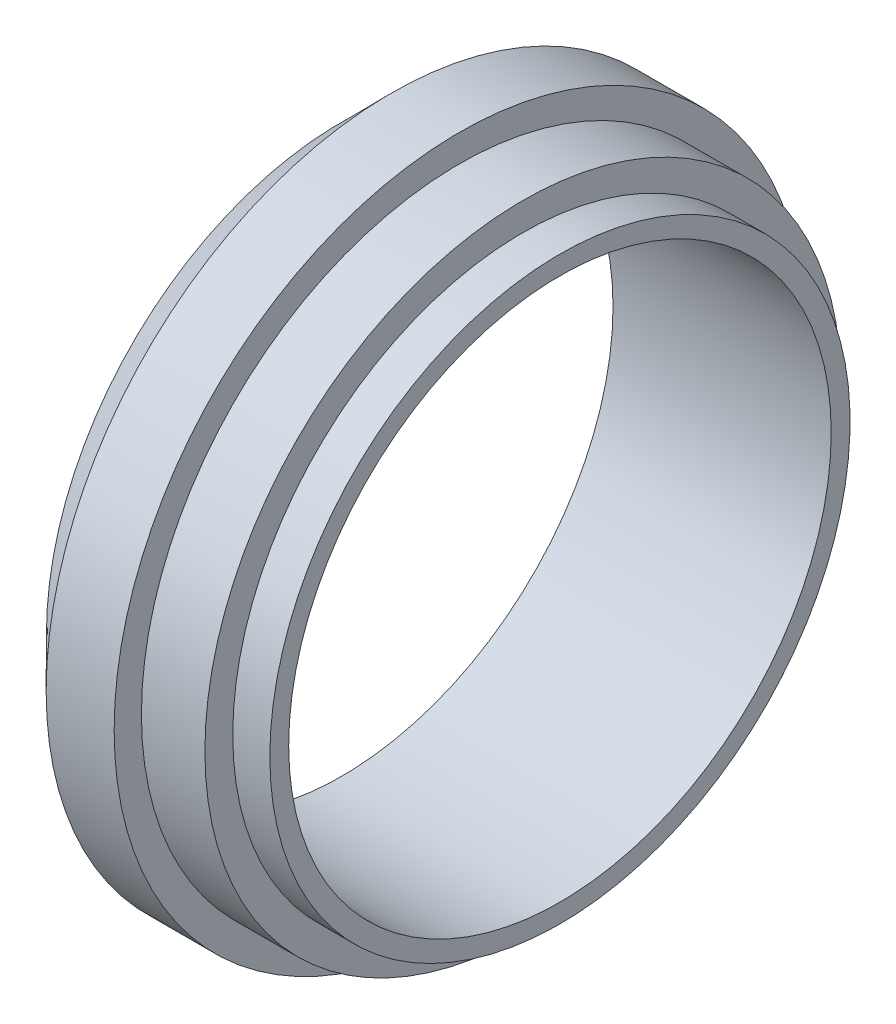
ISO-10303-21;
HEADER;
FILE_DESCRIPTION(('STEP AP214'),'2;1');
FILE_NAME('part.step','',(''),(''),'','','');
FILE_SCHEMA(('AUTOMOTIVE_DESIGN { 1 0 10303 214 1 1 1 1 }'));
ENDSEC;
DATA;
#1=APPLICATION_CONTEXT('core data for automotive mechanical design processes');
#2=APPLICATION_PROTOCOL_DEFINITION('international standard','automotive_design',2000,#1);
#3=PRODUCT_CONTEXT('',#1,'mechanical');
#4=PRODUCT('Part','Part','',(#3));
#5=PRODUCT_RELATED_PRODUCT_CATEGORY('part','',(#4));
#6=PRODUCT_DEFINITION_FORMATION('','',#4);
#7=PRODUCT_DEFINITION_CONTEXT('part definition',#1,'design');
#8=PRODUCT_DEFINITION('design','',#6,#7);
#9=PRODUCT_DEFINITION_SHAPE('','',#8);
#10=(LENGTH_UNIT() NAMED_UNIT(*) SI_UNIT(.MILLI.,.METRE.));
#11=(NAMED_UNIT(*) PLANE_ANGLE_UNIT() SI_UNIT($,.RADIAN.));
#12=(NAMED_UNIT(*) SI_UNIT($,.STERADIAN.) SOLID_ANGLE_UNIT());
#13=UNCERTAINTY_MEASURE_WITH_UNIT(LENGTH_MEASURE(1.E-05),#10,'distance_accuracy_value','');
#14=(GEOMETRIC_REPRESENTATION_CONTEXT(3) GLOBAL_UNCERTAINTY_ASSIGNED_CONTEXT((#13)) GLOBAL_UNIT_ASSIGNED_CONTEXT((#10,
#11,#12)) REPRESENTATION_CONTEXT('',''));
#15=CARTESIAN_POINT('',(0.,0.,0.));
#16=DIRECTION('',(0.,0.,1.));
#17=DIRECTION('',(1.,0.,0.));
#18=AXIS2_PLACEMENT_3D('',#15,#16,#17);
#19=CARTESIAN_POINT('',(0.,25.3999999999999,0.));
#20=DIRECTION('',(1.,0.,0.));
#21=DIRECTION('',(0.,0.,-1.));
#22=AXIS2_PLACEMENT_3D('',#19,#20,#21);
#23=PLANE('',#22);
#24=CARTESIAN_POINT('',(0.,25.3999999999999,0.));
#25=DIRECTION('',(1.,0.,0.));
#26=DIRECTION('',(0.,0.,-1.));
#27=AXIS2_PLACEMENT_3D('',#24,#25,#26);
#28=CIRCLE('',#27,23.749);
#29=CARTESIAN_POINT('',(0.,25.3999999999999,-23.749));
#30=VERTEX_POINT('',#29);
#31=EDGE_CURVE('E70',#30,#30,#28,.T.);
#32=ORIENTED_EDGE('',*,*,#31,.F.);
#33=EDGE_LOOP('',(#32));
#34=FACE_BOUND('',#33,.T.);
#35=CARTESIAN_POINT('',(0.,25.3999999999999,0.));
#36=DIRECTION('',(-1.,0.,0.));
#37=DIRECTION('',(0.,0.,1.));
#38=AXIS2_PLACEMENT_3D('',#35,#36,#37);
#39=CIRCLE('',#38,25.4);
#40=CARTESIAN_POINT('',(0.,25.3999999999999,25.4000000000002));
#41=VERTEX_POINT('',#40);
#42=EDGE_CURVE('E12',#41,#41,#39,.T.);
#43=ORIENTED_EDGE('',*,*,#42,.F.);
#44=EDGE_LOOP('',(#43));
#45=FACE_BOUND('',#44,.T.);
#46=ADVANCED_FACE('F42',(#34,#45),#23,.T.);
#47=CARTESIAN_POINT('',(-19.1008,25.4,0.));
#48=DIRECTION('',(-1.,0.,0.));
#49=DIRECTION('',(0.,0.,1.));
#50=AXIS2_PLACEMENT_3D('',#47,#48,#49);
#51=CYLINDRICAL_SURFACE('',#50,25.4);
#52=ORIENTED_EDGE('',*,*,#42,.T.);
#53=EDGE_LOOP('',(#52));
#54=FACE_BOUND('',#53,.T.);
#55=CARTESIAN_POINT('',(-3.24612000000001,25.4,0.));
#56=DIRECTION('',(-1.,0.,0.));
#57=DIRECTION('',(0.,0.,1.));
#58=AXIS2_PLACEMENT_3D('',#55,#56,#57);
#59=CIRCLE('',#58,25.4);
#60=CARTESIAN_POINT('',(-3.24612,25.4,25.4000000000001));
#61=VERTEX_POINT('',#60);
#62=EDGE_CURVE('E48',#61,#61,#59,.T.);
#63=ORIENTED_EDGE('',*,*,#62,.F.);
#64=EDGE_LOOP('',(#63));
#65=FACE_BOUND('',#64,.T.);
#66=ADVANCED_FACE('F97',(#54,#65),#51,.T.);
#67=CARTESIAN_POINT('',(-3.24612000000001,0.,0.));
#68=DIRECTION('',(1.,0.,0.));
#69=DIRECTION('',(0.,0.,-1.));
#70=AXIS2_PLACEMENT_3D('',#67,#68,#69);
#71=PLANE('',#70);
#72=ORIENTED_EDGE('',*,*,#62,.T.);
#73=EDGE_LOOP('',(#72));
#74=FACE_BOUND('',#73,.T.);
#75=CARTESIAN_POINT('',(-3.24612000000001,25.4,0.));
#76=DIRECTION('',(-1.,0.,0.));
#77=DIRECTION('',(0.,0.,1.));
#78=AXIS2_PLACEMENT_3D('',#75,#76,#77);
#79=CIRCLE('',#78,27.8384);
#80=CARTESIAN_POINT('',(-3.24612,25.4,27.8384000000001));
#81=VERTEX_POINT('',#80);
#82=EDGE_CURVE('E52',#81,#81,#79,.T.);
#83=ORIENTED_EDGE('',*,*,#82,.F.);
#84=EDGE_LOOP('',(#83));
#85=FACE_BOUND('',#84,.T.);
#86=ADVANCED_FACE('F102',(#74,#85),#71,.T.);
#87=CARTESIAN_POINT('',(-19.1008,25.4,0.));
#88=DIRECTION('',(-1.,0.,0.));
#89=DIRECTION('',(0.,0.,1.));
#90=AXIS2_PLACEMENT_3D('',#87,#88,#89);
#91=CYLINDRICAL_SURFACE('',#90,27.8384);
#92=ORIENTED_EDGE('',*,*,#82,.T.);
#93=EDGE_LOOP('',(#92));
#94=FACE_BOUND('',#93,.T.);
#95=CARTESIAN_POINT('',(-8.80364,25.3999999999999,0.));
#96=DIRECTION('',(-1.,0.,0.));
#97=DIRECTION('',(0.,0.,1.));
#98=AXIS2_PLACEMENT_3D('',#95,#96,#97);
#99=CIRCLE('',#98,27.8384);
#100=CARTESIAN_POINT('',(-8.80364,25.3999999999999,27.8384000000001));
#101=VERTEX_POINT('',#100);
#102=EDGE_CURVE('E56',#101,#101,#99,.T.);
#103=ORIENTED_EDGE('',*,*,#102,.F.);
#104=EDGE_LOOP('',(#103));
#105=FACE_BOUND('',#104,.T.);
#106=ADVANCED_FACE('F127',(#94,#105),#91,.T.);
#107=CARTESIAN_POINT('',(-8.80364,-2.43840000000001,0.));
#108=DIRECTION('',(1.,0.,0.));
#109=DIRECTION('',(0.,0.,-1.));
#110=AXIS2_PLACEMENT_3D('',#107,#108,#109);
#111=PLANE('',#110);
#112=ORIENTED_EDGE('',*,*,#102,.T.);
#113=EDGE_LOOP('',(#112));
#114=FACE_BOUND('',#113,.T.);
#115=CARTESIAN_POINT('',(-8.80364,25.3999999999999,0.));
#116=DIRECTION('',(-1.,0.,0.));
#117=DIRECTION('',(0.,0.,1.));
#118=AXIS2_PLACEMENT_3D('',#115,#116,#117);
#119=CIRCLE('',#118,30.226);
#120=CARTESIAN_POINT('',(-8.80364,25.3999999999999,30.2260000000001));
#121=VERTEX_POINT('',#120);
#122=EDGE_CURVE('E61',#121,#121,#119,.T.);
#123=ORIENTED_EDGE('',*,*,#122,.F.);
#124=EDGE_LOOP('',(#123));
#125=FACE_BOUND('',#124,.T.);
#126=ADVANCED_FACE('F93',(#114,#125),#111,.T.);
#127=CARTESIAN_POINT('',(-19.1008,25.4,0.));
#128=DIRECTION('',(-1.,0.,0.));
#129=DIRECTION('',(0.,0.,1.));
#130=AXIS2_PLACEMENT_3D('',#127,#128,#129);
#131=CYLINDRICAL_SURFACE('',#130,30.226);
#132=ORIENTED_EDGE('',*,*,#122,.T.);
#133=EDGE_LOOP('',(#132));
#134=FACE_BOUND('',#133,.T.);
#135=CARTESIAN_POINT('',(-14.7574,25.3999999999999,1.38777878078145E-13));
#136=DIRECTION('',(-1.,0.,0.));
#137=DIRECTION('',(0.,0.,1.));
#138=AXIS2_PLACEMENT_3D('',#135,#136,#137);
#139=CIRCLE('',#138,30.226);
#140=CARTESIAN_POINT('',(-14.7574,25.3999999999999,30.2260000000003));
#141=VERTEX_POINT('',#140);
#142=EDGE_CURVE('E64',#141,#141,#139,.T.);
#143=ORIENTED_EDGE('',*,*,#142,.F.);
#144=EDGE_LOOP('',(#143));
#145=FACE_BOUND('',#144,.T.);
#146=ADVANCED_FACE('F87',(#134,#145),#131,.T.);
#147=CARTESIAN_POINT('',(-19.1008,25.4,0.));
#148=DIRECTION('',(1.,0.,0.));
#149=DIRECTION('',(0.,0.,-1.));
#150=AXIS2_PLACEMENT_3D('',#147,#148,#149);
#151=CONICAL_SURFACE('',#150,25.8572,0.788313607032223);
#152=ORIENTED_EDGE('',*,*,#142,.T.);
#153=EDGE_LOOP('',(#152));
#154=FACE_BOUND('',#153,.T.);
#155=CARTESIAN_POINT('',(-19.1008,25.4,0.));
#156=DIRECTION('',(-1.,0.,0.));
#157=DIRECTION('',(0.,0.,1.));
#158=AXIS2_PLACEMENT_3D('',#155,#156,#157);
#159=CIRCLE('',#158,25.8572);
#160=CARTESIAN_POINT('',(-19.1008,25.4,25.8572000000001));
#161=VERTEX_POINT('',#160);
#162=EDGE_CURVE('E67',#161,#161,#159,.T.);
#163=ORIENTED_EDGE('',*,*,#162,.F.);
#164=EDGE_LOOP('',(#163));
#165=FACE_BOUND('',#164,.T.);
#166=ADVANCED_FACE('F82',(#154,#165),#151,.T.);
#167=CARTESIAN_POINT('',(-19.1008,-0.457200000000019,0.));
#168=DIRECTION('',(-1.,0.,0.));
#169=DIRECTION('',(0.,0.,1.));
#170=AXIS2_PLACEMENT_3D('',#167,#168,#169);
#171=PLANE('',#170);
#172=CARTESIAN_POINT('',(-19.1008,25.4,0.));
#173=DIRECTION('',(-1.,0.,0.));
#174=DIRECTION('',(0.,0.,1.));
#175=AXIS2_PLACEMENT_3D('',#172,#173,#174);
#176=CIRCLE('',#175,23.749);
#177=CARTESIAN_POINT('',(-19.1008,25.4,23.7490000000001));
#178=VERTEX_POINT('',#177);
#179=EDGE_CURVE('E73',#178,#178,#176,.T.);
#180=ORIENTED_EDGE('',*,*,#179,.F.);
#181=EDGE_LOOP('',(#180));
#182=FACE_BOUND('',#181,.T.);
#183=ORIENTED_EDGE('',*,*,#162,.T.);
#184=EDGE_LOOP('',(#183));
#185=FACE_BOUND('',#184,.T.);
#186=ADVANCED_FACE('F79',(#182,#185),#171,.T.);
#187=CARTESIAN_POINT('',(1.5367,25.3999999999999,1.66533453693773E-13));
#188=DIRECTION('',(-1.,0.,0.));
#189=DIRECTION('',(0.,0.,1.));
#190=AXIS2_PLACEMENT_3D('',#187,#188,#189);
#191=CYLINDRICAL_SURFACE('',#190,23.749);
#192=ORIENTED_EDGE('',*,*,#31,.T.);
#193=EDGE_LOOP('',(#192));
#194=FACE_BOUND('',#193,.T.);
#195=ORIENTED_EDGE('',*,*,#179,.T.);
#196=EDGE_LOOP('',(#195));
#197=FACE_BOUND('',#196,.T.);
#198=ADVANCED_FACE('F77',(#194,#197),#191,.F.);
#199=CLOSED_SHELL('',(#46,#66,#86,#106,#126,#146,#166,#186,#198));
#200=MANIFOLD_SOLID_BREP('B2',#199);
#201=ADVANCED_BREP_SHAPE_REPRESENTATION('',(#18,#200),#14);
#202=SHAPE_DEFINITION_REPRESENTATION(#9,#201);
ENDSEC;
END-ISO-10303-21;
